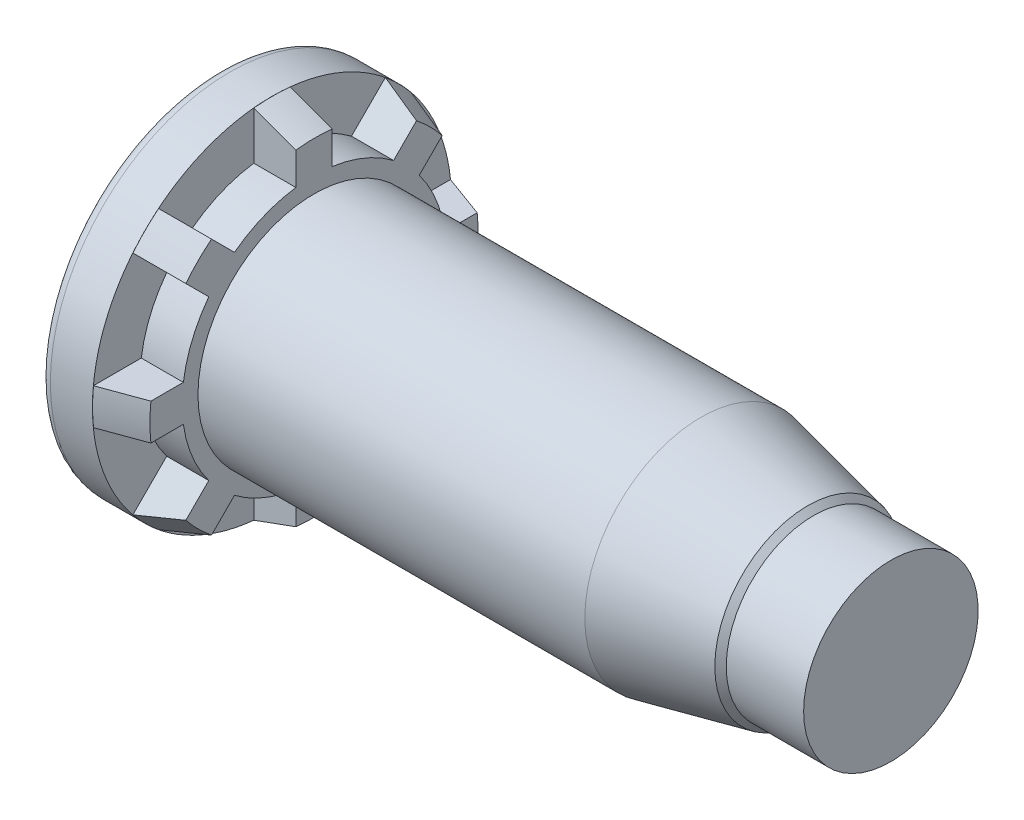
from build123d import *

# Parameters (mm, degrees)
RIBCUT_START     = -1.7272
RIBCUT_DEPTH     = 1.7272
RIBCUTSPAT_COUNT = 8
RIBCUTSPAT_ANGLE = 315


with BuildPart() as part:
    # BodySke → BaseBody (revolve)
    with BuildSketch(Plane.XY, mode=Mode.PRIVATE) as basebody_sk:
        with BuildLine():
            Line((-2.159, 6.9342), (-2.159, 0))
            Line((-2.159, 0), (25.4, 0))
            Line((25.4, 0), (25.4, 3.5814))
            Line((25.4, 3.5814), (22.225, 3.5814))
            Line((22.225, 3.5814), (21.99005, 3.81635))
            Line((21.99005, 3.81635), (17.6022, 4.7625))
            Line((17.6022, 4.7625), (1.7272, 4.7625))
            Line((1.7272, 4.7625), (1.7272, 6.735735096))
            Line((1.7272, 6.735735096), (0.00254, 7.36346))
            Line((0.00254, 7.36346), (0, 7.36346))
            Line((0, 7.36346), (0, 7.366))
            Line((0, 7.366), (-1.7272, 7.366))
            ThreePointArc((-1.7272, 7.366), (-2.032528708, 7.239528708), (-2.159, 6.9342))
        make_face()
    revolve(basebody_sk.sketch.rotate(Axis((0, 0, 0), (1, 0, 0)), 90), axis=Axis((0, 0, 0), (1, 0, 0)))

    # RibCutSke → RibCut (cut)
    with BuildSketch(Plane(origin=(1.7272, 1.794401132, -0.090952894), x_dir=(0, 0, -1), z_dir=(1, 0, 0)).offset(RIBCUT_START)):
        with BuildLine():
            Line((0.654066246, 3.567461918), (0.654066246, 5.533825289))
            ThreePointArc((0.654066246, 5.533825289), (2.727893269, 5.010895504), (4.564077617, 3.91424555))
            Line((4.564077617, 3.91424555), (3.173648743, 2.523816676))
            ThreePointArc((3.173648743, 2.523816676), (1.980656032, 3.206905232), (0.654066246, 3.567461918))
        make_face()
    ribcut = extrude(amount=RIBCUT_DEPTH, mode=Mode.SUBTRACT)

    # RibCutsPat: RibCut ×8 about axis
    ribcutspat_axis = Axis((0, 0, 0), (1, 0, 0))
    for i in range(1, RIBCUTSPAT_COUNT):
        add(ribcut.rotate(ribcutspat_axis, i * RIBCUTSPAT_ANGLE / (RIBCUTSPAT_COUNT - 1)), mode=Mode.SUBTRACT)


solid = part.part
